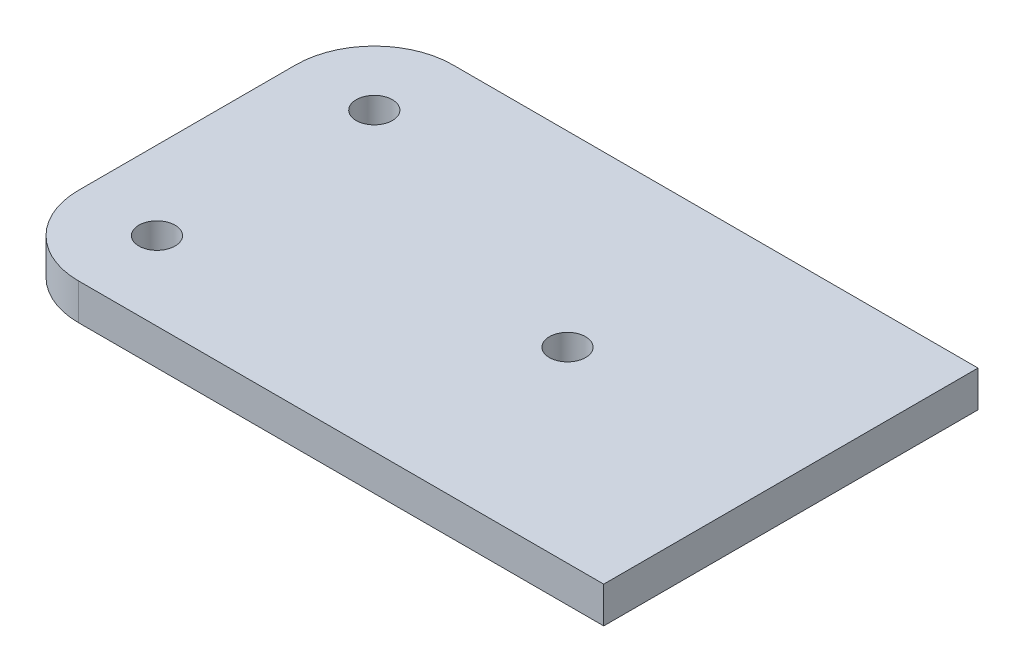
ISO-10303-21;
HEADER;
FILE_DESCRIPTION(('STEP AP214'),'2;1');
FILE_NAME('part.step','',(''),(''),'','','');
FILE_SCHEMA(('AUTOMOTIVE_DESIGN { 1 0 10303 214 1 1 1 1 }'));
ENDSEC;
DATA;
#1=APPLICATION_CONTEXT('core data for automotive mechanical design processes');
#2=APPLICATION_PROTOCOL_DEFINITION('international standard','automotive_design',2000,#1);
#3=PRODUCT_CONTEXT('',#1,'mechanical');
#4=PRODUCT('Part','Part','',(#3));
#5=PRODUCT_RELATED_PRODUCT_CATEGORY('part','',(#4));
#6=PRODUCT_DEFINITION_FORMATION('','',#4);
#7=PRODUCT_DEFINITION_CONTEXT('part definition',#1,'design');
#8=PRODUCT_DEFINITION('design','',#6,#7);
#9=PRODUCT_DEFINITION_SHAPE('','',#8);
#10=(LENGTH_UNIT() NAMED_UNIT(*) SI_UNIT(.MILLI.,.METRE.));
#11=(NAMED_UNIT(*) PLANE_ANGLE_UNIT() SI_UNIT($,.RADIAN.));
#12=(NAMED_UNIT(*) SI_UNIT($,.STERADIAN.) SOLID_ANGLE_UNIT());
#13=UNCERTAINTY_MEASURE_WITH_UNIT(LENGTH_MEASURE(1.E-05),#10,'distance_accuracy_value','');
#14=(GEOMETRIC_REPRESENTATION_CONTEXT(3) GLOBAL_UNCERTAINTY_ASSIGNED_CONTEXT((#13)) GLOBAL_UNIT_ASSIGNED_CONTEXT((#10,
#11,#12)) REPRESENTATION_CONTEXT('',''));
#15=CARTESIAN_POINT('',(0.,0.,0.));
#16=DIRECTION('',(0.,0.,1.));
#17=DIRECTION('',(1.,0.,0.));
#18=AXIS2_PLACEMENT_3D('',#15,#16,#17);
#19=CARTESIAN_POINT('',(13.,6.,-49.));
#20=DIRECTION('',(0.,-1.,0.));
#21=DIRECTION('',(0.,0.,-1.));
#22=AXIS2_PLACEMENT_3D('',#19,#20,#21);
#23=PLANE('',#22);
#24=CARTESIAN_POINT('',(13.,6.,-13.));
#25=DIRECTION('',(0.,1.,0.));
#26=DIRECTION('',(0.,0.,1.));
#27=AXIS2_PLACEMENT_3D('',#24,#25,#26);
#28=CIRCLE('',#27,3.);
#29=CARTESIAN_POINT('',(13.,6.,-10.));
#30=VERTEX_POINT('',#29);
#31=EDGE_CURVE('E195',#30,#30,#28,.T.);
#32=ORIENTED_EDGE('',*,*,#31,.F.);
#33=EDGE_LOOP('',(#32));
#34=FACE_BOUND('',#33,.T.);
#35=DIRECTION('',(0.,0.,-1.));
#36=VECTOR('',#35,1.);
#37=CARTESIAN_POINT('',(100.,6.,0.));
#38=LINE('',#37,#36);
#39=CARTESIAN_POINT('',(100.,6.,0.));
#40=VERTEX_POINT('',#39);
#41=CARTESIAN_POINT('',(100.,6.,-62.));
#42=VERTEX_POINT('',#41);
#43=EDGE_CURVE('E120',#40,#42,#38,.T.);
#44=ORIENTED_EDGE('',*,*,#43,.T.);
#45=DIRECTION('',(-1.,0.,0.));
#46=VECTOR('',#45,1.);
#47=CARTESIAN_POINT('',(13.0000000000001,6.,-62.));
#48=LINE('',#47,#46);
#49=CARTESIAN_POINT('',(13.0000000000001,6.,-62.));
#50=VERTEX_POINT('',#49);
#51=EDGE_CURVE('E101',#42,#50,#48,.T.);
#52=ORIENTED_EDGE('',*,*,#51,.T.);
#53=CARTESIAN_POINT('',(13.,6.,-49.));
#54=DIRECTION('',(0.,1.,0.));
#55=DIRECTION('',(0.,0.,-1.));
#56=AXIS2_PLACEMENT_3D('',#53,#54,#55);
#57=CIRCLE('',#56,13.);
#58=CARTESIAN_POINT('',(0.,6.,-48.9999999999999));
#59=VERTEX_POINT('',#58);
#60=EDGE_CURVE('E123',#50,#59,#57,.T.);
#61=ORIENTED_EDGE('',*,*,#60,.T.);
#62=DIRECTION('',(0.,0.,1.));
#63=VECTOR('',#62,1.);
#64=CARTESIAN_POINT('',(0.,6.,-13.0000000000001));
#65=LINE('',#64,#63);
#66=CARTESIAN_POINT('',(0.,6.,-13.0000000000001));
#67=VERTEX_POINT('',#66);
#68=EDGE_CURVE('E125',#59,#67,#65,.T.);
#69=ORIENTED_EDGE('',*,*,#68,.T.);
#70=CARTESIAN_POINT('',(13.,6.,-13.));
#71=DIRECTION('',(0.,1.,0.));
#72=DIRECTION('',(0.,0.,-1.));
#73=AXIS2_PLACEMENT_3D('',#70,#71,#72);
#74=CIRCLE('',#73,13.);
#75=CARTESIAN_POINT('',(13.0000000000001,6.,0.));
#76=VERTEX_POINT('',#75);
#77=EDGE_CURVE('E54',#67,#76,#74,.T.);
#78=ORIENTED_EDGE('',*,*,#77,.T.);
#79=DIRECTION('',(1.,0.,0.));
#80=VECTOR('',#79,1.);
#81=CARTESIAN_POINT('',(13.0000000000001,6.,0.));
#82=LINE('',#81,#80);
#83=EDGE_CURVE('E49',#76,#40,#82,.T.);
#84=ORIENTED_EDGE('',*,*,#83,.T.);
#85=EDGE_LOOP('',(#44,#52,#61,#69,#78,#84));
#86=FACE_BOUND('',#85,.T.);
#87=CARTESIAN_POINT('',(13.,6.,-49.));
#88=DIRECTION('',(0.,1.,0.));
#89=DIRECTION('',(0.,0.,1.));
#90=AXIS2_PLACEMENT_3D('',#87,#88,#89);
#91=CIRCLE('',#90,3.);
#92=CARTESIAN_POINT('',(13.,6.,-46.));
#93=VERTEX_POINT('',#92);
#94=EDGE_CURVE('E106',#93,#93,#91,.T.);
#95=ORIENTED_EDGE('',*,*,#94,.F.);
#96=EDGE_LOOP('',(#95));
#97=FACE_BOUND('',#96,.T.);
#98=CARTESIAN_POINT('',(63.,6.,-31.));
#99=DIRECTION('',(0.,1.,0.));
#100=DIRECTION('',(0.,0.,1.));
#101=AXIS2_PLACEMENT_3D('',#98,#99,#100);
#102=CIRCLE('',#101,3.00000000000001);
#103=CARTESIAN_POINT('',(63.,6.,-28.));
#104=VERTEX_POINT('',#103);
#105=EDGE_CURVE('E184',#104,#104,#102,.T.);
#106=ORIENTED_EDGE('',*,*,#105,.F.);
#107=EDGE_LOOP('',(#106));
#108=FACE_BOUND('',#107,.T.);
#109=ADVANCED_FACE('F34',(#34,#86,#97,#108),#23,.F.);
#110=CARTESIAN_POINT('',(13.,0.,-49.));
#111=DIRECTION('',(0.,-1.,0.));
#112=DIRECTION('',(0.,0.,-1.));
#113=AXIS2_PLACEMENT_3D('',#110,#111,#112);
#114=PLANE('',#113);
#115=CARTESIAN_POINT('',(13.,0.,-13.));
#116=DIRECTION('',(0.,1.,0.));
#117=DIRECTION('',(0.,0.,1.));
#118=AXIS2_PLACEMENT_3D('',#115,#116,#117);
#119=CIRCLE('',#118,3.);
#120=CARTESIAN_POINT('',(13.,0.,-10.));
#121=VERTEX_POINT('',#120);
#122=EDGE_CURVE('E190',#121,#121,#119,.T.);
#123=ORIENTED_EDGE('',*,*,#122,.T.);
#124=EDGE_LOOP('',(#123));
#125=FACE_BOUND('',#124,.T.);
#126=DIRECTION('',(0.,0.,-1.));
#127=VECTOR('',#126,1.);
#128=CARTESIAN_POINT('',(100.,0.,0.));
#129=LINE('',#128,#127);
#130=CARTESIAN_POINT('',(100.,0.,0.));
#131=VERTEX_POINT('',#130);
#132=CARTESIAN_POINT('',(100.,0.,-62.));
#133=VERTEX_POINT('',#132);
#134=EDGE_CURVE('E92',#131,#133,#129,.T.);
#135=ORIENTED_EDGE('',*,*,#134,.F.);
#136=DIRECTION('',(1.,0.,0.));
#137=VECTOR('',#136,1.);
#138=CARTESIAN_POINT('',(13.0000000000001,0.,0.));
#139=LINE('',#138,#137);
#140=CARTESIAN_POINT('',(13.0000000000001,0.,0.));
#141=VERTEX_POINT('',#140);
#142=EDGE_CURVE('E118',#141,#131,#139,.T.);
#143=ORIENTED_EDGE('',*,*,#142,.F.);
#144=CARTESIAN_POINT('',(13.,0.,-13.));
#145=DIRECTION('',(0.,1.,0.));
#146=DIRECTION('',(0.,0.,-1.));
#147=AXIS2_PLACEMENT_3D('',#144,#145,#146);
#148=CIRCLE('',#147,13.);
#149=CARTESIAN_POINT('',(0.,0.,-13.0000000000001));
#150=VERTEX_POINT('',#149);
#151=EDGE_CURVE('E116',#150,#141,#148,.T.);
#152=ORIENTED_EDGE('',*,*,#151,.F.);
#153=DIRECTION('',(0.,0.,1.));
#154=VECTOR('',#153,1.);
#155=CARTESIAN_POINT('',(0.,0.,-13.0000000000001));
#156=LINE('',#155,#154);
#157=CARTESIAN_POINT('',(0.,0.,-48.9999999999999));
#158=VERTEX_POINT('',#157);
#159=EDGE_CURVE('E114',#158,#150,#156,.T.);
#160=ORIENTED_EDGE('',*,*,#159,.F.);
#161=CARTESIAN_POINT('',(13.,0.,-49.));
#162=DIRECTION('',(0.,1.,0.));
#163=DIRECTION('',(0.,0.,-1.));
#164=AXIS2_PLACEMENT_3D('',#161,#162,#163);
#165=CIRCLE('',#164,13.);
#166=CARTESIAN_POINT('',(13.0000000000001,0.,-62.));
#167=VERTEX_POINT('',#166);
#168=EDGE_CURVE('E94',#167,#158,#165,.T.);
#169=ORIENTED_EDGE('',*,*,#168,.F.);
#170=DIRECTION('',(-1.,0.,0.));
#171=VECTOR('',#170,1.);
#172=CARTESIAN_POINT('',(13.0000000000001,0.,-62.));
#173=LINE('',#172,#171);
#174=EDGE_CURVE('E87',#133,#167,#173,.T.);
#175=ORIENTED_EDGE('',*,*,#174,.F.);
#176=EDGE_LOOP('',(#135,#143,#152,#160,#169,#175));
#177=FACE_BOUND('',#176,.T.);
#178=CARTESIAN_POINT('',(13.,0.,-49.));
#179=DIRECTION('',(0.,1.,0.));
#180=DIRECTION('',(0.,0.,1.));
#181=AXIS2_PLACEMENT_3D('',#178,#179,#180);
#182=CIRCLE('',#181,3.);
#183=CARTESIAN_POINT('',(13.,0.,-46.));
#184=VERTEX_POINT('',#183);
#185=EDGE_CURVE('E109',#184,#184,#182,.T.);
#186=ORIENTED_EDGE('',*,*,#185,.T.);
#187=EDGE_LOOP('',(#186));
#188=FACE_BOUND('',#187,.T.);
#189=CARTESIAN_POINT('',(63.,0.,-31.));
#190=DIRECTION('',(0.,1.,0.));
#191=DIRECTION('',(0.,0.,1.));
#192=AXIS2_PLACEMENT_3D('',#189,#190,#191);
#193=CIRCLE('',#192,3.00000000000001);
#194=CARTESIAN_POINT('',(63.,0.,-28.));
#195=VERTEX_POINT('',#194);
#196=EDGE_CURVE('E187',#195,#195,#193,.T.);
#197=ORIENTED_EDGE('',*,*,#196,.T.);
#198=EDGE_LOOP('',(#197));
#199=FACE_BOUND('',#198,.T.);
#200=ADVANCED_FACE('F88',(#125,#177,#188,#199),#114,.T.);
#201=CARTESIAN_POINT('',(100.,6.,0.));
#202=DIRECTION('',(-1.,0.,0.));
#203=DIRECTION('',(0.,0.,1.));
#204=AXIS2_PLACEMENT_3D('',#201,#202,#203);
#205=PLANE('',#204);
#206=ORIENTED_EDGE('',*,*,#134,.T.);
#207=DIRECTION('',(0.,-1.,0.));
#208=VECTOR('',#207,1.);
#209=CARTESIAN_POINT('',(100.,6.,-62.));
#210=LINE('',#209,#208);
#211=EDGE_CURVE('E11',#42,#133,#210,.T.);
#212=ORIENTED_EDGE('',*,*,#211,.F.);
#213=ORIENTED_EDGE('',*,*,#43,.F.);
#214=DIRECTION('',(0.,-1.,0.));
#215=VECTOR('',#214,1.);
#216=CARTESIAN_POINT('',(100.,6.,0.));
#217=LINE('',#216,#215);
#218=EDGE_CURVE('E105',#40,#131,#217,.T.);
#219=ORIENTED_EDGE('',*,*,#218,.T.);
#220=EDGE_LOOP('',(#206,#212,#213,#219));
#221=FACE_BOUND('',#220,.T.);
#222=ADVANCED_FACE('F36',(#221),#205,.F.);
#223=CARTESIAN_POINT('',(13.0000000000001,6.,-62.));
#224=DIRECTION('',(0.,0.,1.));
#225=DIRECTION('',(1.,0.,0.));
#226=AXIS2_PLACEMENT_3D('',#223,#224,#225);
#227=PLANE('',#226);
#228=ORIENTED_EDGE('',*,*,#174,.T.);
#229=DIRECTION('',(0.,-1.,0.));
#230=VECTOR('',#229,1.);
#231=CARTESIAN_POINT('',(13.0000000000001,6.,-62.));
#232=LINE('',#231,#230);
#233=EDGE_CURVE('E42',#50,#167,#232,.T.);
#234=ORIENTED_EDGE('',*,*,#233,.F.);
#235=ORIENTED_EDGE('',*,*,#51,.F.);
#236=ORIENTED_EDGE('',*,*,#211,.T.);
#237=EDGE_LOOP('',(#228,#234,#235,#236));
#238=FACE_BOUND('',#237,.T.);
#239=ADVANCED_FACE('F100',(#238),#227,.F.);
#240=CARTESIAN_POINT('',(13.,6.,-49.));
#241=DIRECTION('',(0.,-1.,0.));
#242=DIRECTION('',(0.,0.,-1.));
#243=AXIS2_PLACEMENT_3D('',#240,#241,#242);
#244=CYLINDRICAL_SURFACE('',#243,13.);
#245=ORIENTED_EDGE('',*,*,#168,.T.);
#246=DIRECTION('',(0.,-1.,0.));
#247=VECTOR('',#246,1.);
#248=CARTESIAN_POINT('',(0.,6.,-48.9999999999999));
#249=LINE('',#248,#247);
#250=EDGE_CURVE('E136',#59,#158,#249,.T.);
#251=ORIENTED_EDGE('',*,*,#250,.F.);
#252=ORIENTED_EDGE('',*,*,#60,.F.);
#253=ORIENTED_EDGE('',*,*,#233,.T.);
#254=EDGE_LOOP('',(#245,#251,#252,#253));
#255=FACE_BOUND('',#254,.T.);
#256=ADVANCED_FACE('F140',(#255),#244,.T.);
#257=CARTESIAN_POINT('',(0.,6.,-13.0000000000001));
#258=DIRECTION('',(1.,0.,0.));
#259=DIRECTION('',(0.,0.,-1.));
#260=AXIS2_PLACEMENT_3D('',#257,#258,#259);
#261=PLANE('',#260);
#262=ORIENTED_EDGE('',*,*,#159,.T.);
#263=DIRECTION('',(0.,-1.,0.));
#264=VECTOR('',#263,1.);
#265=CARTESIAN_POINT('',(0.,6.,-13.0000000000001));
#266=LINE('',#265,#264);
#267=EDGE_CURVE('E133',#67,#150,#266,.T.);
#268=ORIENTED_EDGE('',*,*,#267,.F.);
#269=ORIENTED_EDGE('',*,*,#68,.F.);
#270=ORIENTED_EDGE('',*,*,#250,.T.);
#271=EDGE_LOOP('',(#262,#268,#269,#270));
#272=FACE_BOUND('',#271,.T.);
#273=ADVANCED_FACE('F146',(#272),#261,.F.);
#274=CARTESIAN_POINT('',(13.,6.,-13.));
#275=DIRECTION('',(0.,-1.,0.));
#276=DIRECTION('',(0.,0.,-1.));
#277=AXIS2_PLACEMENT_3D('',#274,#275,#276);
#278=CYLINDRICAL_SURFACE('',#277,13.);
#279=ORIENTED_EDGE('',*,*,#151,.T.);
#280=DIRECTION('',(0.,-1.,0.));
#281=VECTOR('',#280,1.);
#282=CARTESIAN_POINT('',(13.0000000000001,6.,0.));
#283=LINE('',#282,#281);
#284=EDGE_CURVE('E130',#76,#141,#283,.T.);
#285=ORIENTED_EDGE('',*,*,#284,.F.);
#286=ORIENTED_EDGE('',*,*,#77,.F.);
#287=ORIENTED_EDGE('',*,*,#267,.T.);
#288=EDGE_LOOP('',(#279,#285,#286,#287));
#289=FACE_BOUND('',#288,.T.);
#290=ADVANCED_FACE('F149',(#289),#278,.T.);
#291=CARTESIAN_POINT('',(13.0000000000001,6.,0.));
#292=DIRECTION('',(0.,0.,-1.));
#293=DIRECTION('',(-1.,0.,0.));
#294=AXIS2_PLACEMENT_3D('',#291,#292,#293);
#295=PLANE('',#294);
#296=ORIENTED_EDGE('',*,*,#142,.T.);
#297=ORIENTED_EDGE('',*,*,#218,.F.);
#298=ORIENTED_EDGE('',*,*,#83,.F.);
#299=ORIENTED_EDGE('',*,*,#284,.T.);
#300=EDGE_LOOP('',(#296,#297,#298,#299));
#301=FACE_BOUND('',#300,.T.);
#302=ADVANCED_FACE('F151',(#301),#295,.F.);
#303=CARTESIAN_POINT('',(13.,6.,-49.));
#304=DIRECTION('',(0.,-1.,0.));
#305=DIRECTION('',(0.,0.,-1.));
#306=AXIS2_PLACEMENT_3D('',#303,#304,#305);
#307=CYLINDRICAL_SURFACE('',#306,3.);
#308=ORIENTED_EDGE('',*,*,#94,.T.);
#309=EDGE_LOOP('',(#308));
#310=FACE_BOUND('',#309,.T.);
#311=ORIENTED_EDGE('',*,*,#185,.F.);
#312=EDGE_LOOP('',(#311));
#313=FACE_BOUND('',#312,.T.);
#314=ADVANCED_FACE('F153',(#310,#313),#307,.F.);
#315=CARTESIAN_POINT('',(13.,6.,-13.));
#316=DIRECTION('',(0.,-1.,0.));
#317=DIRECTION('',(0.,0.,-1.));
#318=AXIS2_PLACEMENT_3D('',#315,#316,#317);
#319=CYLINDRICAL_SURFACE('',#318,3.);
#320=ORIENTED_EDGE('',*,*,#31,.T.);
#321=EDGE_LOOP('',(#320));
#322=FACE_BOUND('',#321,.T.);
#323=ORIENTED_EDGE('',*,*,#122,.F.);
#324=EDGE_LOOP('',(#323));
#325=FACE_BOUND('',#324,.T.);
#326=ADVANCED_FACE('F159',(#322,#325),#319,.F.);
#327=CARTESIAN_POINT('',(63.,6.,-31.));
#328=DIRECTION('',(0.,-1.,0.));
#329=DIRECTION('',(0.,0.,-1.));
#330=AXIS2_PLACEMENT_3D('',#327,#328,#329);
#331=CYLINDRICAL_SURFACE('',#330,3.00000000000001);
#332=ORIENTED_EDGE('',*,*,#105,.T.);
#333=EDGE_LOOP('',(#332));
#334=FACE_BOUND('',#333,.T.);
#335=ORIENTED_EDGE('',*,*,#196,.F.);
#336=EDGE_LOOP('',(#335));
#337=FACE_BOUND('',#336,.T.);
#338=ADVANCED_FACE('F175',(#334,#337),#331,.F.);
#339=CLOSED_SHELL('',(#109,#200,#222,#239,#256,#273,#290,#302,#314,#326,#338));
#340=MANIFOLD_SOLID_BREP('B2',#339);
#341=ADVANCED_BREP_SHAPE_REPRESENTATION('',(#18,#340),#14);
#342=SHAPE_DEFINITION_REPRESENTATION(#9,#341);
ENDSEC;
END-ISO-10303-21;
